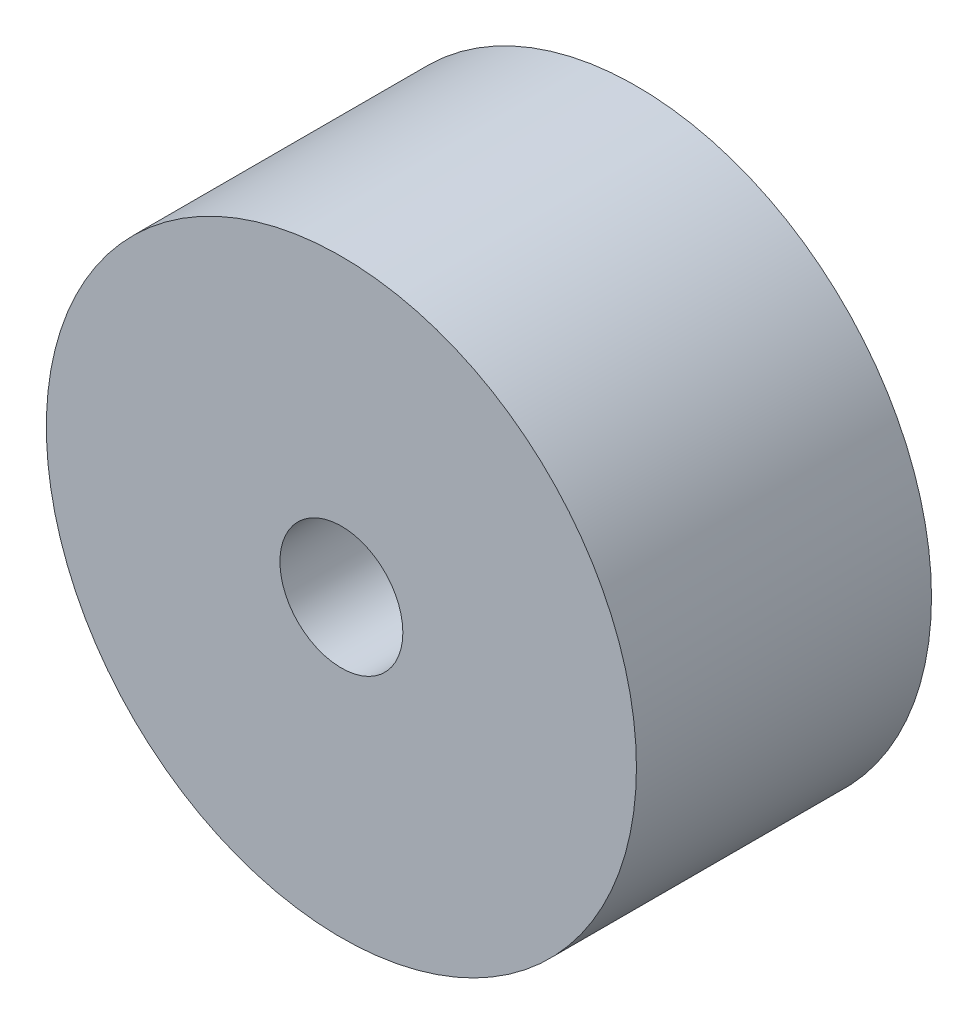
from build123d import *

# Parameters (mm, degrees)
IZIM1_R                     = 6
IZIM1_R_2                   = 1.25
Y_KSEKLIK_EKSTR_ZYON1_DEPTH = 6


with BuildPart() as part:
    # izim1 → Y_kseklik-Ekstr_zyon1 (new body)
    with BuildSketch(Plane.XY):
        Circle(IZIM1_R)
        Circle(IZIM1_R_2, mode=Mode.SUBTRACT)
    extrude(amount=Y_KSEKLIK_EKSTR_ZYON1_DEPTH)


solid = part.part
